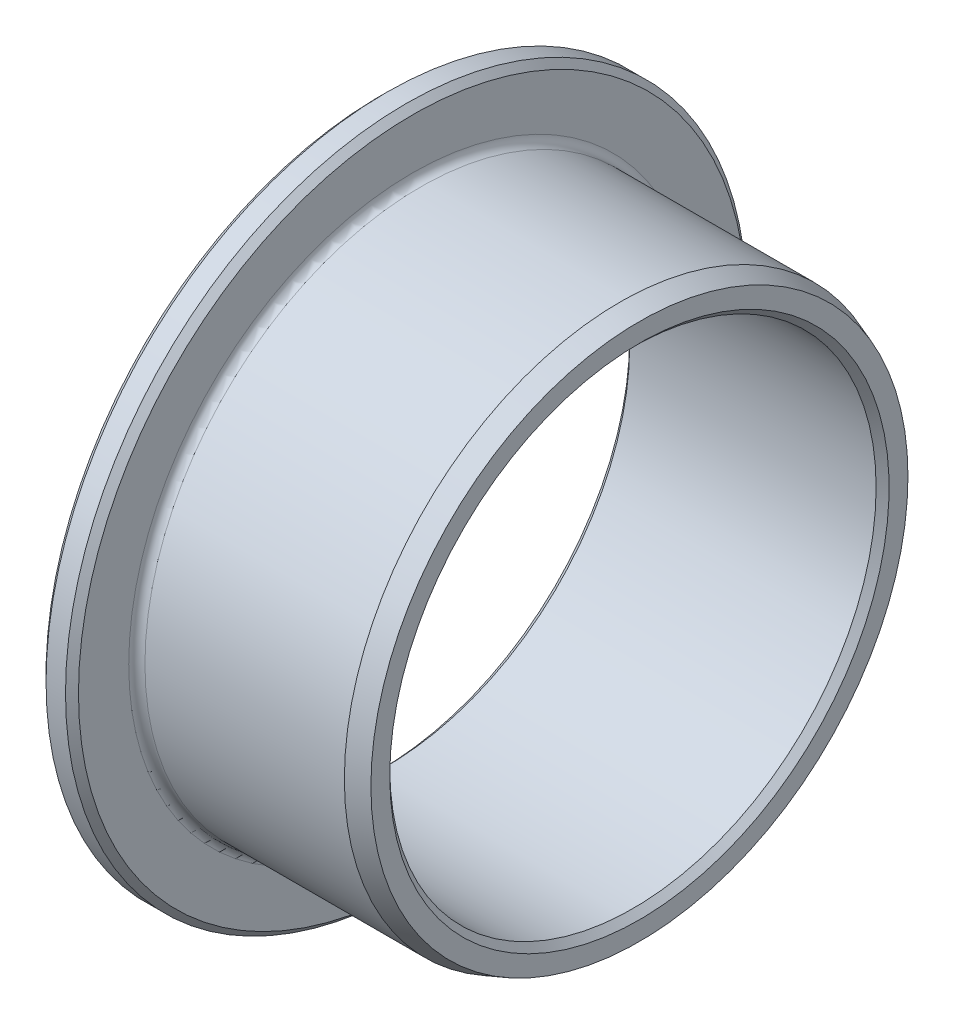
ISO-10303-21;
HEADER;
FILE_DESCRIPTION(('STEP AP214'),'2;1');
FILE_NAME('part.step','',(''),(''),'','','');
FILE_SCHEMA(('AUTOMOTIVE_DESIGN { 1 0 10303 214 1 1 1 1 }'));
ENDSEC;
DATA;
#1=APPLICATION_CONTEXT('core data for automotive mechanical design processes');
#2=APPLICATION_PROTOCOL_DEFINITION('international standard','automotive_design',2000,#1);
#3=PRODUCT_CONTEXT('',#1,'mechanical');
#4=PRODUCT('Part','Part','',(#3));
#5=PRODUCT_RELATED_PRODUCT_CATEGORY('part','',(#4));
#6=PRODUCT_DEFINITION_FORMATION('','',#4);
#7=PRODUCT_DEFINITION_CONTEXT('part definition',#1,'design');
#8=PRODUCT_DEFINITION('design','',#6,#7);
#9=PRODUCT_DEFINITION_SHAPE('','',#8);
#10=(LENGTH_UNIT() NAMED_UNIT(*) SI_UNIT(.MILLI.,.METRE.));
#11=(NAMED_UNIT(*) PLANE_ANGLE_UNIT() SI_UNIT($,.RADIAN.));
#12=(NAMED_UNIT(*) SI_UNIT($,.STERADIAN.) SOLID_ANGLE_UNIT());
#13=UNCERTAINTY_MEASURE_WITH_UNIT(LENGTH_MEASURE(1.E-05),#10,'distance_accuracy_value','');
#14=(GEOMETRIC_REPRESENTATION_CONTEXT(3) GLOBAL_UNCERTAINTY_ASSIGNED_CONTEXT((#13)) GLOBAL_UNIT_ASSIGNED_CONTEXT((#10,
#11,#12)) REPRESENTATION_CONTEXT('',''));
#15=CARTESIAN_POINT('',(0.,0.,0.));
#16=DIRECTION('',(0.,0.,1.));
#17=DIRECTION('',(1.,0.,0.));
#18=AXIS2_PLACEMENT_3D('',#15,#16,#17);
#19=CARTESIAN_POINT('',(0.,21.,0.));
#20=DIRECTION('',(-1.,0.,0.));
#21=DIRECTION('',(0.,0.,1.));
#22=AXIS2_PLACEMENT_3D('',#19,#20,#21);
#23=PLANE('',#22);
#24=CARTESIAN_POINT('',(0.,0.,0.));
#25=DIRECTION('',(-1.,0.,0.));
#26=DIRECTION('',(0.,0.,1.));
#27=AXIS2_PLACEMENT_3D('',#24,#25,#26);
#28=CIRCLE('',#27,20.6);
#29=CARTESIAN_POINT('',(0.,0.,20.6));
#30=VERTEX_POINT('',#29);
#31=EDGE_CURVE('E55',#30,#30,#28,.F.);
#32=ORIENTED_EDGE('',*,*,#31,.T.);
#33=EDGE_LOOP('',(#32));
#34=FACE_BOUND('',#33,.T.);
#35=CARTESIAN_POINT('',(0.,0.,0.));
#36=DIRECTION('',(-1.,0.,0.));
#37=DIRECTION('',(0.,0.,1.));
#38=AXIS2_PLACEMENT_3D('',#35,#36,#37);
#39=CIRCLE('',#38,17.5);
#40=CARTESIAN_POINT('',(0.,0.,17.5));
#41=VERTEX_POINT('',#40);
#42=EDGE_CURVE('E73',#41,#41,#39,.T.);
#43=ORIENTED_EDGE('',*,*,#42,.T.);
#44=EDGE_LOOP('',(#43));
#45=FACE_BOUND('',#44,.T.);
#46=ADVANCED_FACE('F32',(#34,#45),#23,.F.);
#47=CARTESIAN_POINT('',(-5.31268266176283,0.,0.));
#48=DIRECTION('',(-1.,0.,0.));
#49=DIRECTION('',(0.,0.,1.));
#50=AXIS2_PLACEMENT_3D('',#47,#48,#49);
#51=CYLINDRICAL_SURFACE('',#50,17.);
#52=CARTESIAN_POINT('',(12.8,0.,0.));
#53=DIRECTION('',(-1.,0.,0.));
#54=DIRECTION('',(0.,0.,1.));
#55=AXIS2_PLACEMENT_3D('',#52,#53,#54);
#56=CIRCLE('',#55,17.);
#57=CARTESIAN_POINT('',(12.8,0.,17.));
#58=VERTEX_POINT('',#57);
#59=EDGE_CURVE('E39',#58,#58,#56,.T.);
#60=ORIENTED_EDGE('',*,*,#59,.T.);
#61=EDGE_LOOP('',(#60));
#62=FACE_BOUND('',#61,.T.);
#63=CARTESIAN_POINT('',(0.5,0.,0.));
#64=DIRECTION('',(-1.,0.,0.));
#65=DIRECTION('',(0.,0.,1.));
#66=AXIS2_PLACEMENT_3D('',#63,#64,#65);
#67=CIRCLE('',#66,17.);
#68=CARTESIAN_POINT('',(0.5,0.,17.));
#69=VERTEX_POINT('',#68);
#70=EDGE_CURVE('E70',#69,#69,#67,.F.);
#71=ORIENTED_EDGE('',*,*,#70,.T.);
#72=EDGE_LOOP('',(#71));
#73=FACE_BOUND('',#72,.T.);
#74=ADVANCED_FACE('F96',(#62,#73),#51,.T.);
#75=CARTESIAN_POINT('',(14.,17.,0.));
#76=DIRECTION('',(-1.,0.,0.));
#77=DIRECTION('',(0.,0.,1.));
#78=AXIS2_PLACEMENT_3D('',#75,#76,#77);
#79=PLANE('',#78);
#80=CARTESIAN_POINT('',(14.,0.,0.));
#81=DIRECTION('',(-1.,0.,0.));
#82=DIRECTION('',(0.,0.,1.));
#83=AXIS2_PLACEMENT_3D('',#80,#81,#82);
#84=CIRCLE('',#83,16.5632357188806);
#85=CARTESIAN_POINT('',(14.,0.,16.5632357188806));
#86=VERTEX_POINT('',#85);
#87=EDGE_CURVE('E10',#86,#86,#84,.F.);
#88=ORIENTED_EDGE('',*,*,#87,.T.);
#89=EDGE_LOOP('',(#88));
#90=FACE_BOUND('',#89,.T.);
#91=CARTESIAN_POINT('',(14.,0.,0.));
#92=DIRECTION('',(-1.,0.,0.));
#93=DIRECTION('',(0.,0.,1.));
#94=AXIS2_PLACEMENT_3D('',#91,#92,#93);
#95=CIRCLE('',#94,15.4);
#96=CARTESIAN_POINT('',(14.,0.,15.4));
#97=VERTEX_POINT('',#96);
#98=EDGE_CURVE('E52',#97,#97,#95,.T.);
#99=ORIENTED_EDGE('',*,*,#98,.T.);
#100=EDGE_LOOP('',(#99));
#101=FACE_BOUND('',#100,.T.);
#102=ADVANCED_FACE('F101',(#90,#101),#79,.F.);
#103=CARTESIAN_POINT('',(-5.31268266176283,0.,0.));
#104=DIRECTION('',(-1.,0.,0.));
#105=DIRECTION('',(0.,0.,1.));
#106=AXIS2_PLACEMENT_3D('',#103,#104,#105);
#107=CYLINDRICAL_SURFACE('',#106,15.);
#108=CARTESIAN_POINT('',(13.6,0.,0.));
#109=DIRECTION('',(-1.,0.,0.));
#110=DIRECTION('',(0.,0.,1.));
#111=AXIS2_PLACEMENT_3D('',#108,#109,#110);
#112=CIRCLE('',#111,15.);
#113=CARTESIAN_POINT('',(13.6,0.,15.));
#114=VERTEX_POINT('',#113);
#115=EDGE_CURVE('E43',#114,#114,#112,.F.);
#116=ORIENTED_EDGE('',*,*,#115,.T.);
#117=EDGE_LOOP('',(#116));
#118=FACE_BOUND('',#117,.T.);
#119=CARTESIAN_POINT('',(-1.60000000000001,0.,0.));
#120=DIRECTION('',(1.,0.,0.));
#121=DIRECTION('',(0.,0.,-1.));
#122=AXIS2_PLACEMENT_3D('',#119,#120,#121);
#123=CIRCLE('',#122,15.);
#124=CARTESIAN_POINT('',(-1.60000000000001,0.,-15.));
#125=VERTEX_POINT('',#124);
#126=EDGE_CURVE('E47',#125,#125,#123,.F.);
#127=ORIENTED_EDGE('',*,*,#126,.T.);
#128=EDGE_LOOP('',(#127));
#129=FACE_BOUND('',#128,.T.);
#130=ADVANCED_FACE('F106',(#118,#129),#107,.F.);
#131=CARTESIAN_POINT('',(-2.,15.,0.));
#132=DIRECTION('',(1.,0.,0.));
#133=DIRECTION('',(0.,0.,-1.));
#134=AXIS2_PLACEMENT_3D('',#131,#132,#133);
#135=PLANE('',#134);
#136=CARTESIAN_POINT('',(-2.,0.,0.));
#137=DIRECTION('',(1.,0.,0.));
#138=DIRECTION('',(0.,0.,-1.));
#139=AXIS2_PLACEMENT_3D('',#136,#137,#138);
#140=CIRCLE('',#139,20.6);
#141=CARTESIAN_POINT('',(-2.,0.,-20.6));
#142=VERTEX_POINT('',#141);
#143=EDGE_CURVE('E64',#142,#142,#140,.F.);
#144=ORIENTED_EDGE('',*,*,#143,.T.);
#145=EDGE_LOOP('',(#144));
#146=FACE_BOUND('',#145,.T.);
#147=CARTESIAN_POINT('',(-2.,0.,0.));
#148=DIRECTION('',(1.,0.,0.));
#149=DIRECTION('',(0.,0.,-1.));
#150=AXIS2_PLACEMENT_3D('',#147,#148,#149);
#151=CIRCLE('',#150,15.4);
#152=CARTESIAN_POINT('',(-2.,0.,-15.4));
#153=VERTEX_POINT('',#152);
#154=EDGE_CURVE('E67',#153,#153,#151,.T.);
#155=ORIENTED_EDGE('',*,*,#154,.T.);
#156=EDGE_LOOP('',(#155));
#157=FACE_BOUND('',#156,.T.);
#158=ADVANCED_FACE('F91',(#146,#157),#135,.F.);
#159=CARTESIAN_POINT('',(-5.31268266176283,0.,0.));
#160=DIRECTION('',(-1.,0.,0.));
#161=DIRECTION('',(0.,0.,1.));
#162=AXIS2_PLACEMENT_3D('',#159,#160,#161);
#163=CYLINDRICAL_SURFACE('',#162,21.);
#164=CARTESIAN_POINT('',(-1.6,0.,0.));
#165=DIRECTION('',(1.,0.,0.));
#166=DIRECTION('',(0.,0.,-1.));
#167=AXIS2_PLACEMENT_3D('',#164,#165,#166);
#168=CIRCLE('',#167,21.);
#169=CARTESIAN_POINT('',(-1.6,0.,-21.));
#170=VERTEX_POINT('',#169);
#171=EDGE_CURVE('E58',#170,#170,#168,.T.);
#172=ORIENTED_EDGE('',*,*,#171,.T.);
#173=EDGE_LOOP('',(#172));
#174=FACE_BOUND('',#173,.T.);
#175=CARTESIAN_POINT('',(-0.400000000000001,0.,0.));
#176=DIRECTION('',(-1.,0.,0.));
#177=DIRECTION('',(0.,0.,1.));
#178=AXIS2_PLACEMENT_3D('',#175,#176,#177);
#179=CIRCLE('',#178,21.);
#180=CARTESIAN_POINT('',(-0.400000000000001,0.,21.));
#181=VERTEX_POINT('',#180);
#182=EDGE_CURVE('E61',#181,#181,#179,.T.);
#183=ORIENTED_EDGE('',*,*,#182,.T.);
#184=EDGE_LOOP('',(#183));
#185=FACE_BOUND('',#184,.T.);
#186=ADVANCED_FACE('F81',(#174,#185),#163,.T.);
#187=CARTESIAN_POINT('',(0.5,0.,0.));
#188=DIRECTION('',(-1.,0.,0.));
#189=DIRECTION('',(0.,0.,1.));
#190=AXIS2_PLACEMENT_3D('',#187,#188,#189);
#191=TOROIDAL_SURFACE('',#190,17.5,0.5);
#192=ORIENTED_EDGE('',*,*,#70,.F.);
#193=EDGE_LOOP('',(#192));
#194=FACE_BOUND('',#193,.T.);
#195=ORIENTED_EDGE('',*,*,#42,.F.);
#196=EDGE_LOOP('',(#195));
#197=FACE_BOUND('',#196,.T.);
#198=ADVANCED_FACE('F78',(#194,#197),#191,.F.);
#199=CARTESIAN_POINT('',(-2.,0.,0.));
#200=DIRECTION('',(1.,0.,0.));
#201=DIRECTION('',(0.,0.,-1.));
#202=AXIS2_PLACEMENT_3D('',#199,#200,#201);
#203=CONICAL_SURFACE('',#202,20.6,0.78539816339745);
#204=CARTESIAN_POINT('',(-1.6,0.,-21.));
#205=CARTESIAN_POINT('',(-1.60416666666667,0.,-20.9958333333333));
#206=CARTESIAN_POINT('',(-1.60833333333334,0.,-20.9916666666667));
#207=CARTESIAN_POINT('',(-1.61666666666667,0.,-20.9833333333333));
#208=CARTESIAN_POINT('',(-1.62083333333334,0.,-20.9791666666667));
#209=CARTESIAN_POINT('',(-1.62916666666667,0.,-20.9708333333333));
#210=CARTESIAN_POINT('',(-1.63333333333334,0.,-20.9666666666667));
#211=CARTESIAN_POINT('',(-1.64166666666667,0.,-20.9583333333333));
#212=CARTESIAN_POINT('',(-1.64583333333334,0.,-20.9541666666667));
#213=CARTESIAN_POINT('',(-1.65416666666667,0.,-20.9458333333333));
#214=CARTESIAN_POINT('',(-1.65833333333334,0.,-20.9416666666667));
#215=CARTESIAN_POINT('',(-1.66666666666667,0.,-20.9333333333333));
#216=CARTESIAN_POINT('',(-1.67083333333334,0.,-20.9291666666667));
#217=CARTESIAN_POINT('',(-1.67916666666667,0.,-20.9208333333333));
#218=CARTESIAN_POINT('',(-1.68333333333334,0.,-20.9166666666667));
#219=CARTESIAN_POINT('',(-1.69166666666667,0.,-20.9083333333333));
#220=CARTESIAN_POINT('',(-1.69583333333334,0.,-20.9041666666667));
#221=CARTESIAN_POINT('',(-1.70416666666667,0.,-20.8958333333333));
#222=CARTESIAN_POINT('',(-1.70833333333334,0.,-20.8916666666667));
#223=CARTESIAN_POINT('',(-1.71666666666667,0.,-20.8833333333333));
#224=CARTESIAN_POINT('',(-1.72083333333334,0.,-20.8791666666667));
#225=CARTESIAN_POINT('',(-1.72916666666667,0.,-20.8708333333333));
#226=CARTESIAN_POINT('',(-1.73333333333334,0.,-20.8666666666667));
#227=CARTESIAN_POINT('',(-1.74166666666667,0.,-20.8583333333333));
#228=CARTESIAN_POINT('',(-1.74583333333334,0.,-20.8541666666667));
#229=CARTESIAN_POINT('',(-1.75416666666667,0.,-20.8458333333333));
#230=CARTESIAN_POINT('',(-1.75833333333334,0.,-20.8416666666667));
#231=CARTESIAN_POINT('',(-1.76666666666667,0.,-20.8333333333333));
#232=CARTESIAN_POINT('',(-1.77083333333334,0.,-20.8291666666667));
#233=CARTESIAN_POINT('',(-1.77916666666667,0.,-20.8208333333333));
#234=CARTESIAN_POINT('',(-1.78333333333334,0.,-20.8166666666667));
#235=CARTESIAN_POINT('',(-1.79166666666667,0.,-20.8083333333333));
#236=CARTESIAN_POINT('',(-1.79583333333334,0.,-20.8041666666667));
#237=CARTESIAN_POINT('',(-1.80416666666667,0.,-20.7958333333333));
#238=CARTESIAN_POINT('',(-1.80833333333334,0.,-20.7916666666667));
#239=CARTESIAN_POINT('',(-1.81666666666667,0.,-20.7833333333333));
#240=CARTESIAN_POINT('',(-1.82083333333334,0.,-20.7791666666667));
#241=CARTESIAN_POINT('',(-1.82916666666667,0.,-20.7708333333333));
#242=CARTESIAN_POINT('',(-1.83333333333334,0.,-20.7666666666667));
#243=CARTESIAN_POINT('',(-1.84166666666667,0.,-20.7583333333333));
#244=CARTESIAN_POINT('',(-1.84583333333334,0.,-20.7541666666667));
#245=CARTESIAN_POINT('',(-1.85416666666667,0.,-20.7458333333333));
#246=CARTESIAN_POINT('',(-1.85833333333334,0.,-20.7416666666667));
#247=CARTESIAN_POINT('',(-1.86666666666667,0.,-20.7333333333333));
#248=CARTESIAN_POINT('',(-1.87083333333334,0.,-20.7291666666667));
#249=CARTESIAN_POINT('',(-1.87916666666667,0.,-20.7208333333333));
#250=CARTESIAN_POINT('',(-1.88333333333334,0.,-20.7166666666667));
#251=CARTESIAN_POINT('',(-1.89166666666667,0.,-20.7083333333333));
#252=CARTESIAN_POINT('',(-1.89583333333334,0.,-20.7041666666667));
#253=CARTESIAN_POINT('',(-1.90416666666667,0.,-20.6958333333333));
#254=CARTESIAN_POINT('',(-1.90833333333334,0.,-20.6916666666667));
#255=CARTESIAN_POINT('',(-1.91666666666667,0.,-20.6833333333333));
#256=CARTESIAN_POINT('',(-1.92083333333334,0.,-20.6791666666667));
#257=CARTESIAN_POINT('',(-1.92916666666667,0.,-20.6708333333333));
#258=CARTESIAN_POINT('',(-1.93333333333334,0.,-20.6666666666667));
#259=CARTESIAN_POINT('',(-1.94166666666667,0.,-20.6583333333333));
#260=CARTESIAN_POINT('',(-1.94583333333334,0.,-20.6541666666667));
#261=CARTESIAN_POINT('',(-1.95416666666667,0.,-20.6458333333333));
#262=CARTESIAN_POINT('',(-1.95833333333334,0.,-20.6416666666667));
#263=CARTESIAN_POINT('',(-1.96666666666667,0.,-20.6333333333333));
#264=CARTESIAN_POINT('',(-1.97083333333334,0.,-20.6291666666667));
#265=CARTESIAN_POINT('',(-1.97916666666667,0.,-20.6208333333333));
#266=CARTESIAN_POINT('',(-1.98333333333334,0.,-20.6166666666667));
#267=CARTESIAN_POINT('',(-1.99166666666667,0.,-20.6083333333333));
#268=CARTESIAN_POINT('',(-1.99583333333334,0.,-20.6041666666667));
#269=CARTESIAN_POINT('',(-2.,0.,-20.6));
#270=B_SPLINE_CURVE_WITH_KNOTS('',3,(#204,#205,#206,#207,#208,#209,#210,#211,#212,#213,#214,
#215,#216,#217,#218,#219,#220,#221,#222,#223,#224,#225,#226,#227,#228,#229,#230,#231,#232,#233,
#234,#235,#236,#237,#238,#239,#240,#241,#242,#243,#244,#245,#246,#247,#248,#249,#250,#251,#252,
#253,#254,#255,#256,#257,#258,#259,#260,#261,#262,#263,#264,#265,#266,#267,#268,#269),
.UNSPECIFIED.,.F.,.F.,(4,2,2,2,2,2,2,2,2,2,2,2,2,2,2,2,2,2,2,2,2,2,2,2,2,2,2,2,2,2,2,2,4),(0.,
0.0176776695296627,0.0353553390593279,0.0530330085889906,0.0707106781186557,0.0883883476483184,
0.106066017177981,0.123743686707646,0.141421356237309,0.159099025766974,0.176776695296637,
0.194454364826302,0.212132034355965,0.229809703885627,0.247487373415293,0.265165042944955,
0.282842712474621,0.300520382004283,0.318198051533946,0.335875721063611,0.353553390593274,
0.371231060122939,0.388908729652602,0.406586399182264,0.42426406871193,0.441941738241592,
0.459619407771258,0.47729707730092,0.494974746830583,0.512652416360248,0.530330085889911,
0.548007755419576,0.565685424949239),.UNSPECIFIED.);
#271=EDGE_CURVE('BSEAM80',#170,#142,#270,.T.);
#272=ORIENTED_EDGE('',*,*,#171,.F.);
#273=ORIENTED_EDGE('',*,*,#143,.F.);
#274=ORIENTED_EDGE('',*,*,#271,.T.);
#275=ORIENTED_EDGE('',*,*,#271,.F.);
#276=EDGE_LOOP('',(#272,#274,#273,#275));
#277=FACE_BOUND('',#276,.T.);
#278=ADVANCED_FACE('F80',(#277),#203,.T.);
#279=CARTESIAN_POINT('',(-0.400000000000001,0.,0.));
#280=DIRECTION('',(-1.,0.,0.));
#281=DIRECTION('',(0.,0.,1.));
#282=AXIS2_PLACEMENT_3D('',#279,#280,#281);
#283=CONICAL_SURFACE('',#282,21.,0.785398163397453);
#284=ORIENTED_EDGE('',*,*,#31,.F.);
#285=EDGE_LOOP('',(#284));
#286=FACE_BOUND('',#285,.T.);
#287=ORIENTED_EDGE('',*,*,#182,.F.);
#288=EDGE_LOOP('',(#287));
#289=FACE_BOUND('',#288,.T.);
#290=ADVANCED_FACE('F88',(#286,#289),#283,.T.);
#291=CARTESIAN_POINT('',(14.,0.,0.));
#292=DIRECTION('',(1.,0.,0.));
#293=DIRECTION('',(0.,0.,-1.));
#294=AXIS2_PLACEMENT_3D('',#291,#292,#293);
#295=CONICAL_SURFACE('',#294,15.4,0.785398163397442);
#296=ORIENTED_EDGE('',*,*,#115,.F.);
#297=EDGE_LOOP('',(#296));
#298=FACE_BOUND('',#297,.T.);
#299=ORIENTED_EDGE('',*,*,#98,.F.);
#300=EDGE_LOOP('',(#299));
#301=FACE_BOUND('',#300,.T.);
#302=ADVANCED_FACE('F121',(#298,#301),#295,.F.);
#303=CARTESIAN_POINT('',(-1.60000000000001,0.,0.));
#304=DIRECTION('',(-1.,0.,0.));
#305=DIRECTION('',(0.,0.,1.));
#306=AXIS2_PLACEMENT_3D('',#303,#304,#305);
#307=CONICAL_SURFACE('',#306,15.,0.78539816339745);
#308=ORIENTED_EDGE('',*,*,#154,.F.);
#309=EDGE_LOOP('',(#308));
#310=FACE_BOUND('',#309,.T.);
#311=ORIENTED_EDGE('',*,*,#126,.F.);
#312=EDGE_LOOP('',(#311));
#313=FACE_BOUND('',#312,.T.);
#314=ADVANCED_FACE('F118',(#310,#313),#307,.F.);
#315=CARTESIAN_POINT('',(12.8,0.,0.));
#316=DIRECTION('',(-1.,0.,0.));
#317=DIRECTION('',(0.,0.,1.));
#318=AXIS2_PLACEMENT_3D('',#315,#316,#317);
#319=CONICAL_SURFACE('',#318,17.,0.349065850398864);
#320=ORIENTED_EDGE('',*,*,#87,.F.);
#321=EDGE_LOOP('',(#320));
#322=FACE_BOUND('',#321,.T.);
#323=ORIENTED_EDGE('',*,*,#59,.F.);
#324=EDGE_LOOP('',(#323));
#325=FACE_BOUND('',#324,.T.);
#326=ADVANCED_FACE('F34',(#322,#325),#319,.T.);
#327=CLOSED_SHELL('',(#46,#74,#102,#130,#158,#186,#198,#278,#290,#302,#314,#326));
#328=MANIFOLD_SOLID_BREP('B2',#327);
#329=ADVANCED_BREP_SHAPE_REPRESENTATION('',(#18,#328),#14);
#330=SHAPE_DEFINITION_REPRESENTATION(#9,#329);
ENDSEC;
END-ISO-10303-21;
